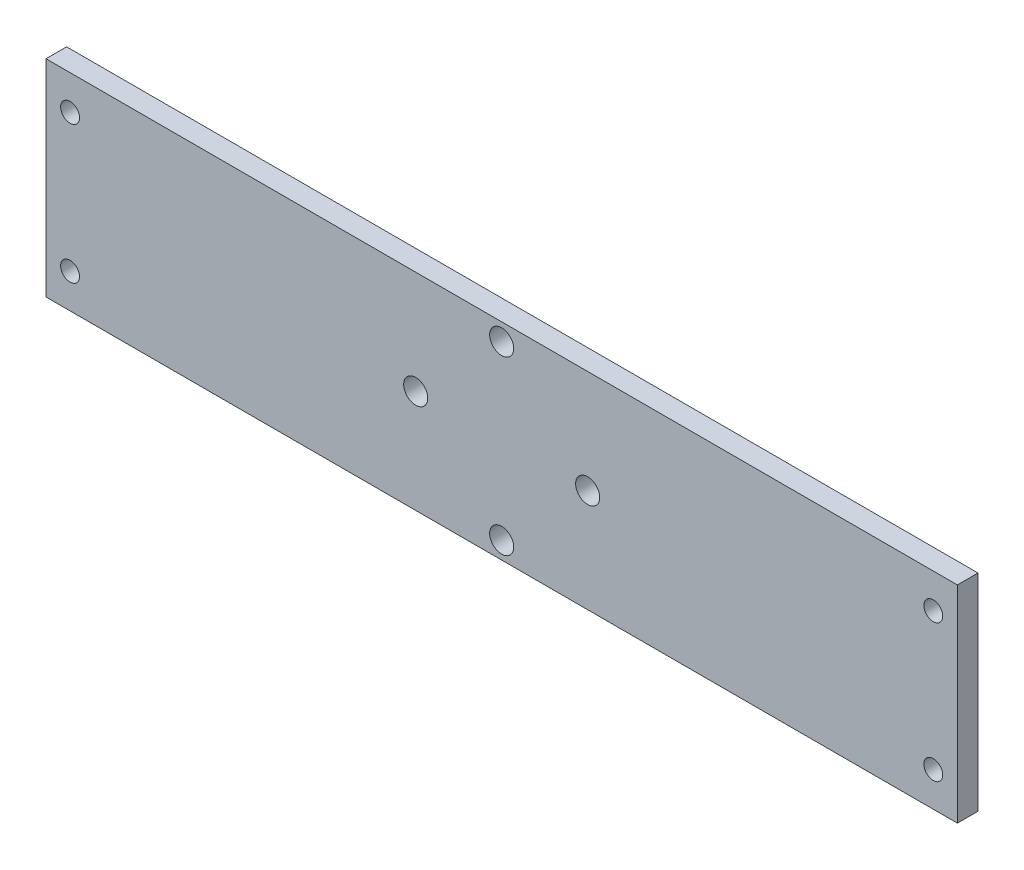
from build123d import *

# Parameters (mm, degrees)
SKETCH1_W           = 265
SKETCH1_H           = 60
SKETCH1_R           = 2.75
SKETCH1_R_2         = 3.5
BOSS_EXTRUDE1_DEPTH = 6


with BuildPart() as part:
    # Sketch1 → Boss-Extrude1 (new body)
    with BuildSketch(Plane.XY):
        Rectangle(SKETCH1_W, SKETCH1_H)
        with Locations((-125.5, 20)):
            Circle(SKETCH1_R, mode=Mode.SUBTRACT)
        with Locations(Location((-125.5, -20, 0), (0, 0, 180))):
            Circle(SKETCH1_R, mode=Mode.SUBTRACT)
        with Locations((125.5, -20)):
            Circle(SKETCH1_R, mode=Mode.SUBTRACT)
        with Locations(Location((125.5, 20, 0), (0, 0, 180))):
            Circle(SKETCH1_R, mode=Mode.SUBTRACT)
        with Locations((0, 25)):
            Circle(SKETCH1_R_2, mode=Mode.SUBTRACT)
        with Locations((25, 0)):
            Circle(SKETCH1_R_2, mode=Mode.SUBTRACT)
        with Locations((0, -25)):
            Circle(SKETCH1_R_2, mode=Mode.SUBTRACT)
        with Locations((-25, 0)):
            Circle(SKETCH1_R_2, mode=Mode.SUBTRACT)
    extrude(amount=BOSS_EXTRUDE1_DEPTH)


solid = part.part
